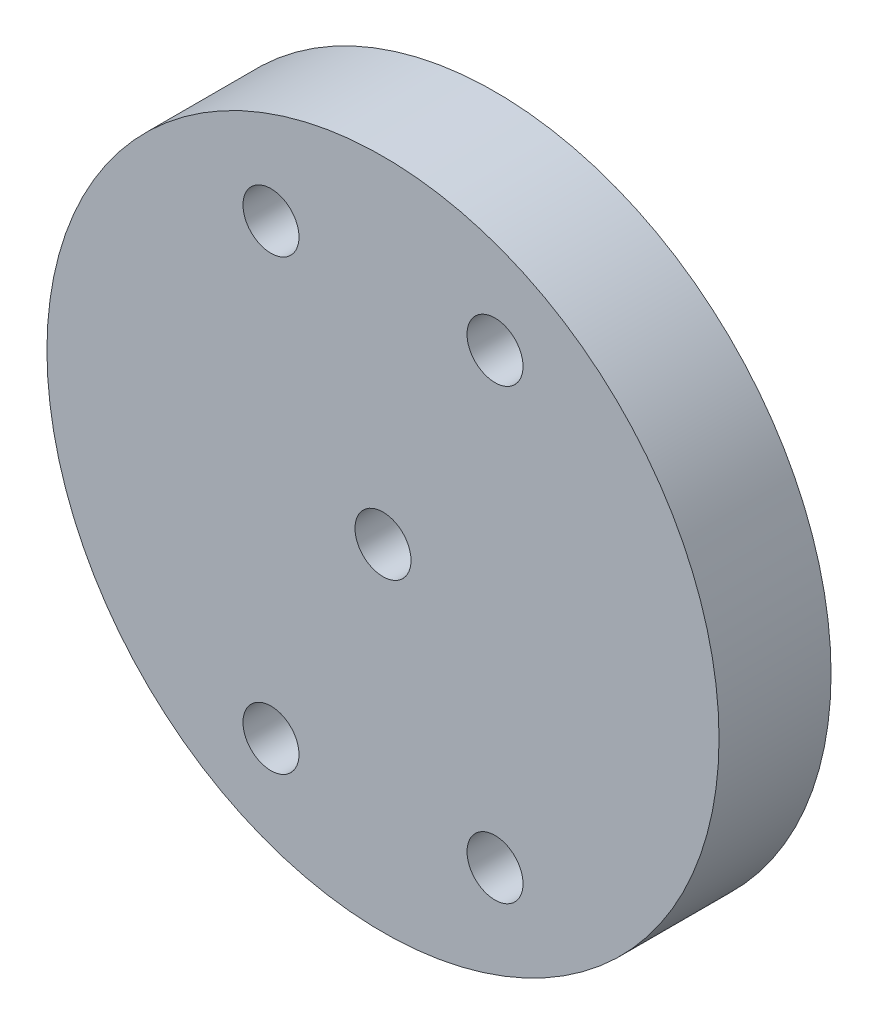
from build123d import *

# Parameters (mm, degrees)
SKETCH1_R               = 38.1
BOSS_EXTRUDE1_DEPTH     = 12.7
F_1_4_20_TAPPED_HOLE1_D = 6.35


with BuildPart() as part:
    # Sketch1 → Boss-Extrude1 (new body)
    with BuildSketch(Plane.XY):
        Circle(SKETCH1_R)
    extrude(amount=BOSS_EXTRUDE1_DEPTH)

    # 1_4-20 Tapped Hole1 (through all)
    with Locations(Plane.XY.offset(12.7)):
        with Locations((12.7, 25.4), (-12.7, 25.4), (-12.7, -25.4), (12.7, -25.4), (0, 0)):
            Hole(F_1_4_20_TAPPED_HOLE1_D / 2)


solid = part.part
